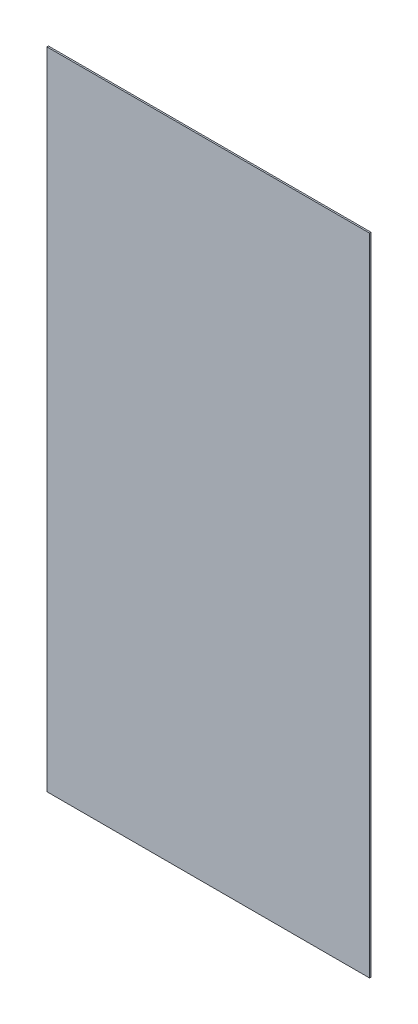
from build123d import *

# Parameters (mm, degrees)
SKETCH1_W           = 609.6
SKETCH1_H           = 1219.2
BOSS_EXTRUDE1_DEPTH = 2.8575


with BuildPart() as part:
    # Sketch1 → Boss-Extrude1 (new body)
    with BuildSketch(Plane.XY):
        with Locations((304.8, 609.6)):
            Rectangle(SKETCH1_W, SKETCH1_H)
    extrude(amount=BOSS_EXTRUDE1_DEPTH)


solid = part.part
